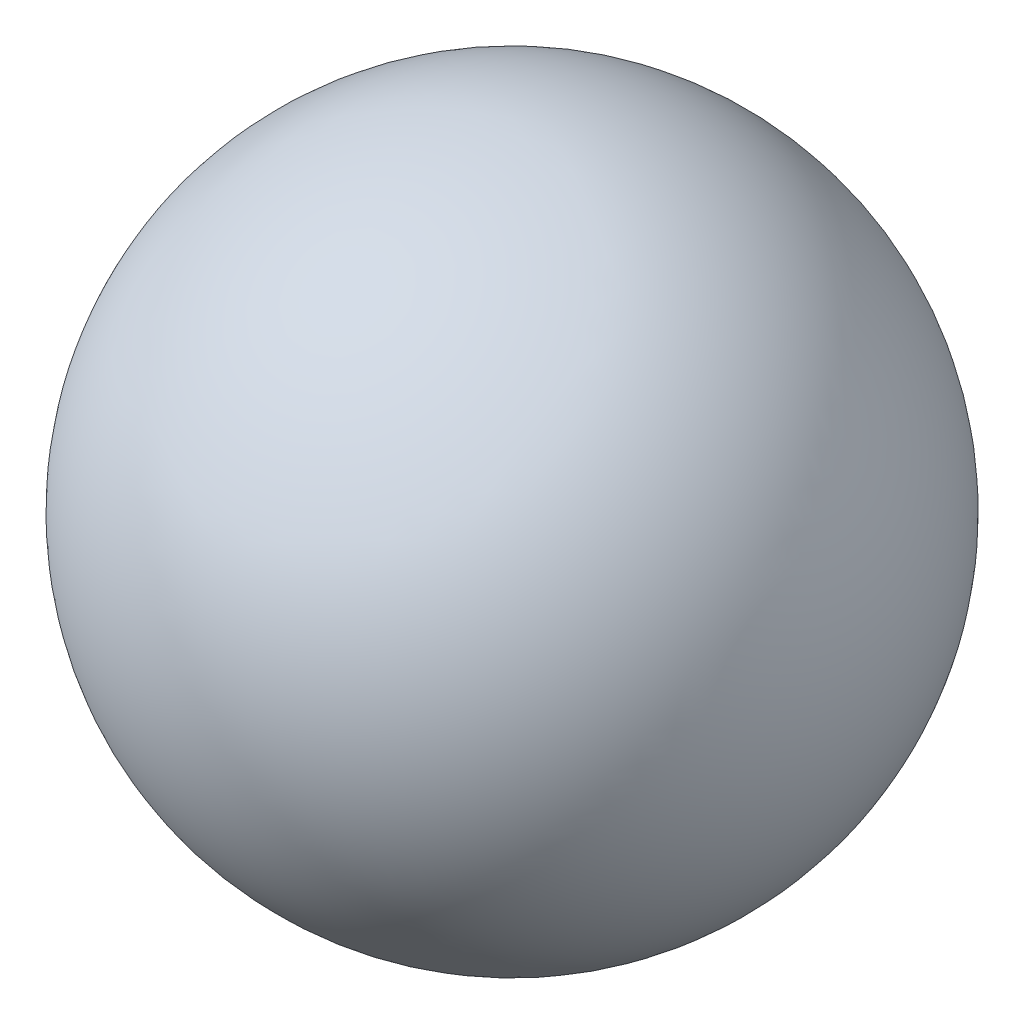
ISO-10303-21;
HEADER;
FILE_DESCRIPTION(('STEP AP214'),'2;1');
FILE_NAME('part.step','',(''),(''),'','','');
FILE_SCHEMA(('AUTOMOTIVE_DESIGN { 1 0 10303 214 1 1 1 1 }'));
ENDSEC;
DATA;
#1=APPLICATION_CONTEXT('core data for automotive mechanical design processes');
#2=APPLICATION_PROTOCOL_DEFINITION('international standard','automotive_design',2000,#1);
#3=PRODUCT_CONTEXT('',#1,'mechanical');
#4=PRODUCT('Part','Part','',(#3));
#5=PRODUCT_RELATED_PRODUCT_CATEGORY('part','',(#4));
#6=PRODUCT_DEFINITION_FORMATION('','',#4);
#7=PRODUCT_DEFINITION_CONTEXT('part definition',#1,'design');
#8=PRODUCT_DEFINITION('design','',#6,#7);
#9=PRODUCT_DEFINITION_SHAPE('','',#8);
#10=(LENGTH_UNIT() NAMED_UNIT(*) SI_UNIT(.MILLI.,.METRE.));
#11=(NAMED_UNIT(*) PLANE_ANGLE_UNIT() SI_UNIT($,.RADIAN.));
#12=(NAMED_UNIT(*) SI_UNIT($,.STERADIAN.) SOLID_ANGLE_UNIT());
#13=UNCERTAINTY_MEASURE_WITH_UNIT(LENGTH_MEASURE(1.E-05),#10,'distance_accuracy_value','');
#14=(GEOMETRIC_REPRESENTATION_CONTEXT(3) GLOBAL_UNCERTAINTY_ASSIGNED_CONTEXT((#13)) GLOBAL_UNIT_ASSIGNED_CONTEXT((#10,
#11,#12)) REPRESENTATION_CONTEXT('',''));
#15=CARTESIAN_POINT('',(0.,0.,0.));
#16=DIRECTION('',(0.,0.,1.));
#17=DIRECTION('',(1.,0.,0.));
#18=AXIS2_PLACEMENT_3D('',#15,#16,#17);
#19=CARTESIAN_POINT('',(0.,0.,0.));
#20=DIRECTION('',(1.,0.,0.));
#21=DIRECTION('',(0.,-1.,0.));
#22=AXIS2_PLACEMENT_3D('',#19,#20,#21);
#23=SPHERICAL_SURFACE('',#22,5.5);
#24=CARTESIAN_POINT('',(5.5,0.,0.));
#25=VERTEX_POINT('',#24);
#26=VERTEX_LOOP('',#25);
#27=FACE_BOUND('',#26,.T.);
#28=ADVANCED_FACE('F32',(#27),#23,.T.);
#29=CLOSED_SHELL('',(#28));
#30=MANIFOLD_SOLID_BREP('B2',#29);
#31=ADVANCED_BREP_SHAPE_REPRESENTATION('',(#18,#30),#14);
#32=SHAPE_DEFINITION_REPRESENTATION(#9,#31);
ENDSEC;
END-ISO-10303-21;
